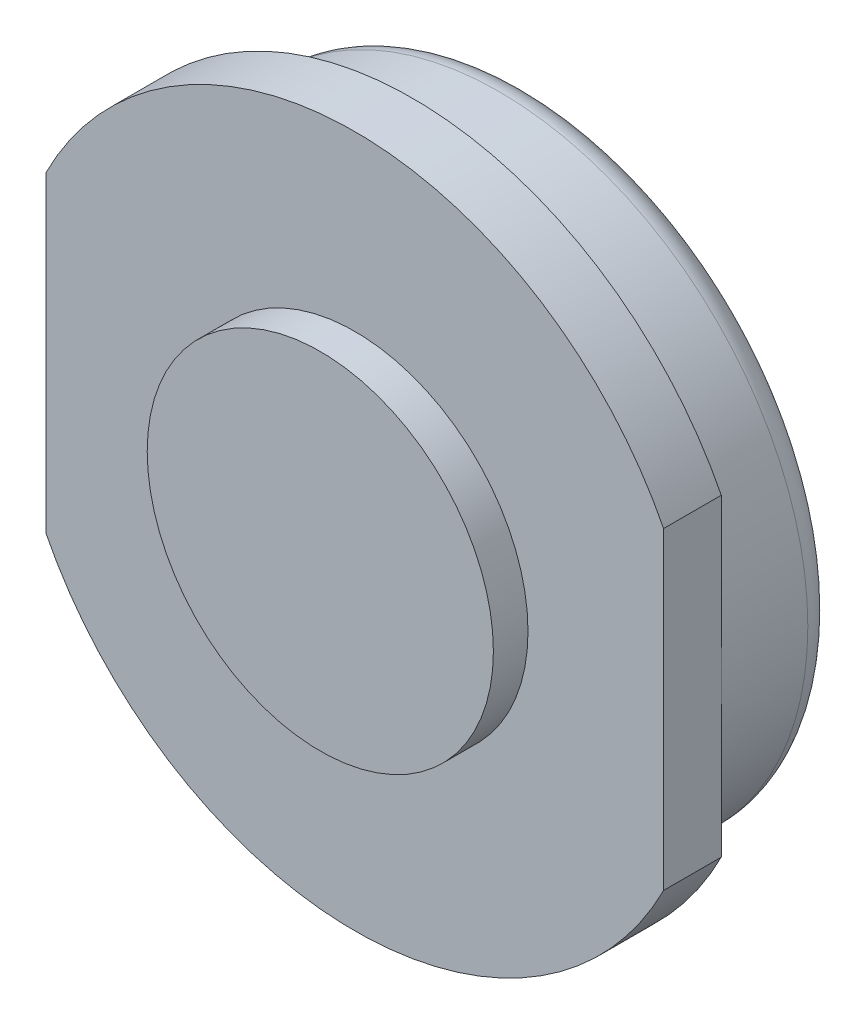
from build123d import *

# Parameters (mm, degrees)
SKETCH_1_R          = 5.35
EXTRUDE_1_DEPTH     = 2
FILLET_1_R          = 0.5
SKETCH_2_R          = 6
EXTRUDE_2_DEPTH     = 1
CUT_EXTRUDE_1_DEPTH = 9.717797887
SKETCH_4_R          = 3
EXTRUDE_3_DEPTH     = 0.6


with BuildPart() as part:
    # Sketch 1 → Extrude 1 (new body)
    with BuildSketch(Plane.XY):
        Circle(SKETCH_1_R)
    extrude(amount=EXTRUDE_1_DEPTH)

    # Fillet 1
    fillet_1_edges = [part.edges().sort_by_distance(p)[0] for p in [
        (-5.35, 0, 0),
    ]]
    fillet(fillet_1_edges, radius=FILLET_1_R)

    # Sketch 2 → Extrude 2 (add)
    with BuildSketch(Plane.XY.offset(2)):
        Circle(SKETCH_2_R)
    extrude(amount=EXTRUDE_2_DEPTH)

    # Sketch 3 → Cut-Extrude 1 (cut, through all)
    with BuildSketch(Plane(origin=(0, 0, 2), x_dir=(-1, 0, 0), z_dir=(0, 0, -1))):
        with BuildLine():
            Line((5.35, 2.716155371), (5.35, -2.716155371))
            ThreePointArc((5.35, -2.716155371), (6, 0), (5.35, 2.716155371))
        make_face()
        with BuildLine():
            Line((-5.35, 2.716155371), (-5.35, -2.716155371))
            ThreePointArc((-5.35, -2.716155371), (-6, 0), (-5.35, 2.716155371))
        make_face()
    extrude(amount=-CUT_EXTRUDE_1_DEPTH, mode=Mode.SUBTRACT)

    # Sketch 4 → Extrude 3 (add)
    with BuildSketch(Plane.XY.offset(3)):
        Circle(SKETCH_4_R)
    extrude(amount=EXTRUDE_3_DEPTH)


solid = part.part
